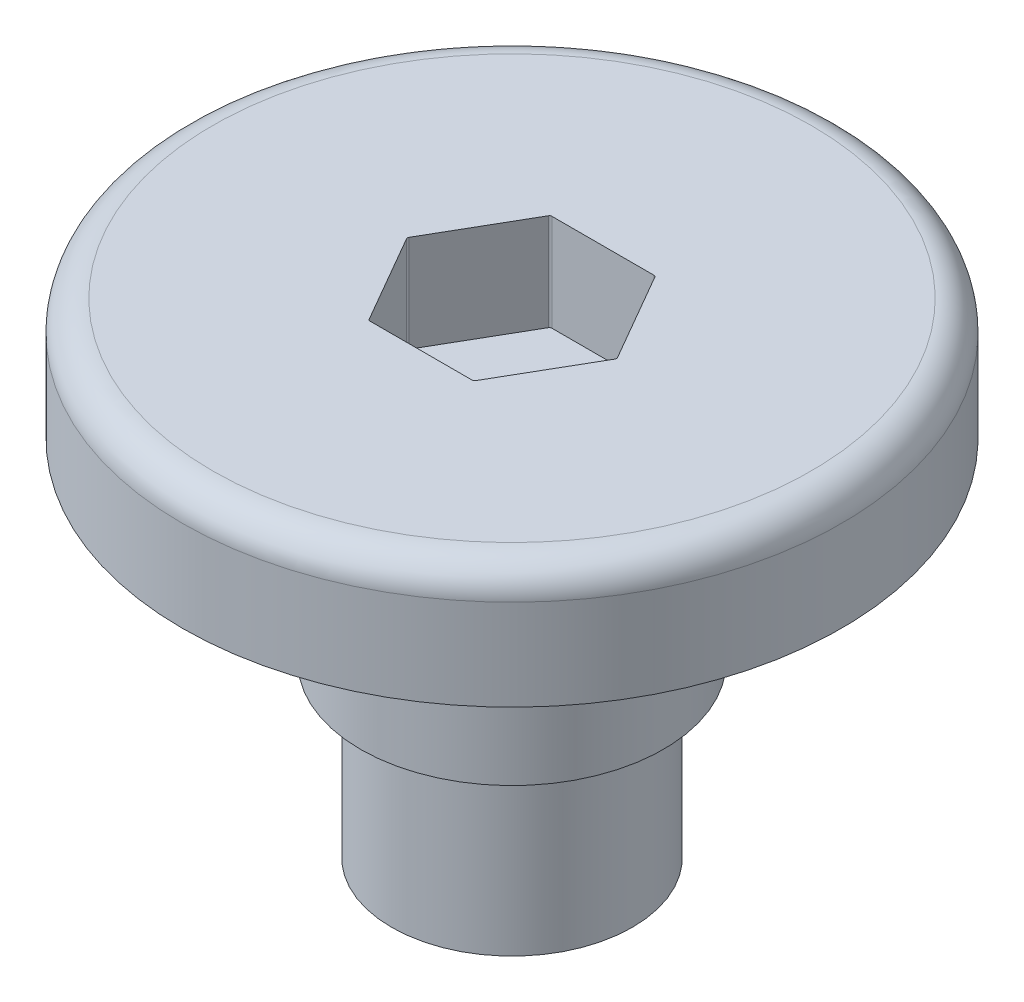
ISO-10303-21;
HEADER;
FILE_DESCRIPTION(('STEP AP214'),'2;1');
FILE_NAME('part.step','',(''),(''),'','','');
FILE_SCHEMA(('AUTOMOTIVE_DESIGN { 1 0 10303 214 1 1 1 1 }'));
ENDSEC;
DATA;
#1=APPLICATION_CONTEXT('core data for automotive mechanical design processes');
#2=APPLICATION_PROTOCOL_DEFINITION('international standard','automotive_design',2000,#1);
#3=PRODUCT_CONTEXT('',#1,'mechanical');
#4=PRODUCT('Part','Part','',(#3));
#5=PRODUCT_RELATED_PRODUCT_CATEGORY('part','',(#4));
#6=PRODUCT_DEFINITION_FORMATION('','',#4);
#7=PRODUCT_DEFINITION_CONTEXT('part definition',#1,'design');
#8=PRODUCT_DEFINITION('design','',#6,#7);
#9=PRODUCT_DEFINITION_SHAPE('','',#8);
#10=(LENGTH_UNIT() NAMED_UNIT(*) SI_UNIT(.MILLI.,.METRE.));
#11=(NAMED_UNIT(*) PLANE_ANGLE_UNIT() SI_UNIT($,.RADIAN.));
#12=(NAMED_UNIT(*) SI_UNIT($,.STERADIAN.) SOLID_ANGLE_UNIT());
#13=UNCERTAINTY_MEASURE_WITH_UNIT(LENGTH_MEASURE(1.E-05),#10,'distance_accuracy_value','');
#14=(GEOMETRIC_REPRESENTATION_CONTEXT(3) GLOBAL_UNCERTAINTY_ASSIGNED_CONTEXT((#13)) GLOBAL_UNIT_ASSIGNED_CONTEXT((#10,
#11,#12)) REPRESENTATION_CONTEXT('',''));
#15=CARTESIAN_POINT('',(0.,0.,0.));
#16=DIRECTION('',(0.,0.,1.));
#17=DIRECTION('',(1.,0.,0.));
#18=AXIS2_PLACEMENT_3D('',#15,#16,#17);
#19=CARTESIAN_POINT('',(-17.272,25.4,0.));
#20=DIRECTION('',(0.,-1.,0.));
#21=DIRECTION('',(0.,0.,-1.));
#22=AXIS2_PLACEMENT_3D('',#19,#20,#21);
#23=PLANE('',#22);
#24=CARTESIAN_POINT('',(0.,25.4,0.));
#25=DIRECTION('',(0.,-1.,0.));
#26=DIRECTION('',(0.,0.,-1.));
#27=AXIS2_PLACEMENT_3D('',#24,#25,#26);
#28=CIRCLE('',#27,15.6845);
#29=CARTESIAN_POINT('',(0.,25.4,-15.6845));
#30=VERTEX_POINT('',#29);
#31=EDGE_CURVE('E250',#30,#30,#28,.F.);
#32=ORIENTED_EDGE('',*,*,#31,.T.);
#33=EDGE_LOOP('',(#32));
#34=FACE_BOUND('',#33,.T.);
#35=DIRECTION('',(-1.,0.,0.));
#36=VECTOR('',#35,1.);
#37=CARTESIAN_POINT('',(2.74963065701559,25.4,-4.7625));
#38=LINE('',#37,#36);
#39=CARTESIAN_POINT('',(2.67630717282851,25.4,-4.7625));
#40=VERTEX_POINT('',#39);
#41=CARTESIAN_POINT('',(-2.67630717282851,25.4,-4.7625));
#42=VERTEX_POINT('',#41);
#43=EDGE_CURVE('E176',#40,#42,#38,.T.);
#44=ORIENTED_EDGE('',*,*,#43,.F.);
#45=CARTESIAN_POINT('',(2.67630717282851,25.4,-4.6355));
#46=DIRECTION('',(0.,-1.,0.));
#47=DIRECTION('',(0.,0.,-1.));
#48=AXIS2_PLACEMENT_3D('',#45,#46,#47);
#49=CIRCLE('',#48,0.127);
#50=CARTESIAN_POINT('',(2.78629239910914,25.4,-4.699));
#51=VERTEX_POINT('',#50);
#52=EDGE_CURVE('E67',#40,#51,#49,.T.);
#53=ORIENTED_EDGE('',*,*,#52,.T.);
#54=DIRECTION('',(-0.5,0.,-0.866025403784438));
#55=VECTOR('',#54,1.);
#56=CARTESIAN_POINT('',(5.49926131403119,25.4,0.));
#57=LINE('',#56,#55);
#58=CARTESIAN_POINT('',(5.46259957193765,25.4,-0.0635000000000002));
#59=VERTEX_POINT('',#58);
#60=EDGE_CURVE('E293',#59,#51,#57,.T.);
#61=ORIENTED_EDGE('',*,*,#60,.F.);
#62=CARTESIAN_POINT('',(5.35261434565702,25.4,0.));
#63=DIRECTION('',(0.,-1.,0.));
#64=DIRECTION('',(0.,0.,-1.));
#65=AXIS2_PLACEMENT_3D('',#62,#63,#64);
#66=CIRCLE('',#65,0.127);
#67=CARTESIAN_POINT('',(5.46259957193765,25.4,0.0634999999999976));
#68=VERTEX_POINT('',#67);
#69=EDGE_CURVE('E290',#59,#68,#66,.T.);
#70=ORIENTED_EDGE('',*,*,#69,.T.);
#71=DIRECTION('',(0.5,0.,-0.866025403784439));
#72=VECTOR('',#71,1.);
#73=CARTESIAN_POINT('',(2.74963065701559,25.4,4.7625));
#74=LINE('',#73,#72);
#75=CARTESIAN_POINT('',(2.78629239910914,25.4,4.699));
#76=VERTEX_POINT('',#75);
#77=EDGE_CURVE('E174',#76,#68,#74,.T.);
#78=ORIENTED_EDGE('',*,*,#77,.F.);
#79=CARTESIAN_POINT('',(2.67630717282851,25.4,4.6355));
#80=DIRECTION('',(0.,-1.,0.));
#81=DIRECTION('',(0.,0.,-1.));
#82=AXIS2_PLACEMENT_3D('',#79,#80,#81);
#83=CIRCLE('',#82,0.127);
#84=CARTESIAN_POINT('',(2.67630717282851,25.4,4.7625));
#85=VERTEX_POINT('',#84);
#86=EDGE_CURVE('E288',#76,#85,#83,.T.);
#87=ORIENTED_EDGE('',*,*,#86,.T.);
#88=DIRECTION('',(1.,0.,0.));
#89=VECTOR('',#88,1.);
#90=CARTESIAN_POINT('',(-2.74963065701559,25.4,4.7625));
#91=LINE('',#90,#89);
#92=CARTESIAN_POINT('',(-2.67630717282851,25.4,4.7625));
#93=VERTEX_POINT('',#92);
#94=EDGE_CURVE('E170',#93,#85,#91,.T.);
#95=ORIENTED_EDGE('',*,*,#94,.F.);
#96=CARTESIAN_POINT('',(-2.67630717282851,25.4,4.6355));
#97=DIRECTION('',(0.,-1.,0.));
#98=DIRECTION('',(0.,0.,-1.));
#99=AXIS2_PLACEMENT_3D('',#96,#97,#98);
#100=CIRCLE('',#99,0.127);
#101=CARTESIAN_POINT('',(-2.78629239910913,25.4,4.699));
#102=VERTEX_POINT('',#101);
#103=EDGE_CURVE('E155',#93,#102,#100,.T.);
#104=ORIENTED_EDGE('',*,*,#103,.T.);
#105=DIRECTION('',(0.5,0.,0.866025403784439));
#106=VECTOR('',#105,1.);
#107=CARTESIAN_POINT('',(-5.49926131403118,25.4,0.));
#108=LINE('',#107,#106);
#109=CARTESIAN_POINT('',(-5.46259957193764,25.4,0.0634999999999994));
#110=VERTEX_POINT('',#109);
#111=EDGE_CURVE('E162',#110,#102,#108,.T.);
#112=ORIENTED_EDGE('',*,*,#111,.F.);
#113=CARTESIAN_POINT('',(-5.35261434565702,25.4,0.));
#114=DIRECTION('',(0.,-1.,0.));
#115=DIRECTION('',(0.,0.,-1.));
#116=AXIS2_PLACEMENT_3D('',#113,#114,#115);
#117=CIRCLE('',#116,0.127);
#118=CARTESIAN_POINT('',(-5.46259957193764,25.4,-0.0635000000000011));
#119=VERTEX_POINT('',#118);
#120=EDGE_CURVE('E147',#110,#119,#117,.T.);
#121=ORIENTED_EDGE('',*,*,#120,.T.);
#122=DIRECTION('',(-0.5,0.,0.866025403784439));
#123=VECTOR('',#122,1.);
#124=CARTESIAN_POINT('',(-2.74963065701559,25.4,-4.7625));
#125=LINE('',#124,#123);
#126=CARTESIAN_POINT('',(-2.78629239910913,25.4,-4.699));
#127=VERTEX_POINT('',#126);
#128=EDGE_CURVE('E171',#127,#119,#125,.T.);
#129=ORIENTED_EDGE('',*,*,#128,.F.);
#130=CARTESIAN_POINT('',(-2.67630717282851,25.4,-4.6355));
#131=DIRECTION('',(0.,-1.,0.));
#132=DIRECTION('',(0.,0.,-1.));
#133=AXIS2_PLACEMENT_3D('',#130,#131,#132);
#134=CIRCLE('',#133,0.127);
#135=EDGE_CURVE('E14',#127,#42,#134,.T.);
#136=ORIENTED_EDGE('',*,*,#135,.T.);
#137=EDGE_LOOP('',(#44,#53,#61,#70,#78,#87,#95,#104,#112,#121,#129,#136));
#138=FACE_BOUND('',#137,.T.);
#139=ADVANCED_FACE('F59',(#34,#138),#23,.F.);
#140=CARTESIAN_POINT('',(0.,0.,0.));
#141=DIRECTION('',(0.,-1.,0.));
#142=DIRECTION('',(0.,0.,-1.));
#143=AXIS2_PLACEMENT_3D('',#140,#141,#142);
#144=CYLINDRICAL_SURFACE('',#143,17.272);
#145=CARTESIAN_POINT('',(0.,23.8125,0.));
#146=DIRECTION('',(0.,-1.,0.));
#147=DIRECTION('',(0.,0.,-1.));
#148=AXIS2_PLACEMENT_3D('',#145,#146,#147);
#149=CIRCLE('',#148,17.272);
#150=CARTESIAN_POINT('',(0.,23.8125,-17.272));
#151=VERTEX_POINT('',#150);
#152=EDGE_CURVE('E247',#151,#151,#149,.T.);
#153=ORIENTED_EDGE('',*,*,#152,.T.);
#154=EDGE_LOOP('',(#153));
#155=FACE_BOUND('',#154,.T.);
#156=CARTESIAN_POINT('',(0.,19.05,0.));
#157=DIRECTION('',(0.,-1.,0.));
#158=DIRECTION('',(0.,0.,-1.));
#159=AXIS2_PLACEMENT_3D('',#156,#157,#158);
#160=CIRCLE('',#159,17.272);
#161=CARTESIAN_POINT('',(0.,19.05,-17.272));
#162=VERTEX_POINT('',#161);
#163=EDGE_CURVE('E244',#162,#162,#160,.T.);
#164=ORIENTED_EDGE('',*,*,#163,.F.);
#165=EDGE_LOOP('',(#164));
#166=FACE_BOUND('',#165,.T.);
#167=ADVANCED_FACE('F337',(#155,#166),#144,.T.);
#168=CARTESIAN_POINT('',(-14.859,19.05,0.));
#169=DIRECTION('',(0.,1.,0.));
#170=DIRECTION('',(0.,0.,1.));
#171=AXIS2_PLACEMENT_3D('',#168,#169,#170);
#172=PLANE('',#171);
#173=CARTESIAN_POINT('',(0.,19.05,0.));
#174=DIRECTION('',(0.,-1.,0.));
#175=DIRECTION('',(0.,0.,-1.));
#176=AXIS2_PLACEMENT_3D('',#173,#174,#175);
#177=CIRCLE('',#176,14.859);
#178=CARTESIAN_POINT('',(0.,19.05,-14.859));
#179=VERTEX_POINT('',#178);
#180=EDGE_CURVE('E241',#179,#179,#177,.T.);
#181=ORIENTED_EDGE('',*,*,#180,.F.);
#182=EDGE_LOOP('',(#181));
#183=FACE_BOUND('',#182,.T.);
#184=ORIENTED_EDGE('',*,*,#163,.T.);
#185=EDGE_LOOP('',(#184));
#186=FACE_BOUND('',#185,.T.);
#187=ADVANCED_FACE('F343',(#183,#186),#172,.F.);
#188=CARTESIAN_POINT('',(0.,19.177,0.));
#189=DIRECTION('',(0.,-1.,0.));
#190=DIRECTION('',(0.,0.,-1.));
#191=AXIS2_PLACEMENT_3D('',#188,#189,#190);
#192=TOROIDAL_SURFACE('',#191,14.859,0.127);
#193=CARTESIAN_POINT('',(0.,19.177,0.));
#194=DIRECTION('',(0.,-1.,0.));
#195=DIRECTION('',(0.,0.,-1.));
#196=AXIS2_PLACEMENT_3D('',#193,#194,#195);
#197=CIRCLE('',#196,14.732);
#198=CARTESIAN_POINT('',(0.,19.177,-14.732));
#199=VERTEX_POINT('',#198);
#200=EDGE_CURVE('E238',#199,#199,#197,.T.);
#201=ORIENTED_EDGE('',*,*,#200,.F.);
#202=EDGE_LOOP('',(#201));
#203=FACE_BOUND('',#202,.T.);
#204=ORIENTED_EDGE('',*,*,#180,.T.);
#205=EDGE_LOOP('',(#204));
#206=FACE_BOUND('',#205,.T.);
#207=ADVANCED_FACE('F660',(#203,#206),#192,.T.);
#208=CARTESIAN_POINT('',(0.,0.,0.));
#209=DIRECTION('',(0.,-1.,0.));
#210=DIRECTION('',(0.,0.,-1.));
#211=AXIS2_PLACEMENT_3D('',#208,#209,#210);
#212=CYLINDRICAL_SURFACE('',#211,14.732);
#213=CARTESIAN_POINT('',(0.,21.2471,0.));
#214=DIRECTION('',(0.,-1.,0.));
#215=DIRECTION('',(0.,0.,-1.));
#216=AXIS2_PLACEMENT_3D('',#213,#214,#215);
#217=CIRCLE('',#216,14.732);
#218=CARTESIAN_POINT('',(0.,21.2471,-14.732));
#219=VERTEX_POINT('',#218);
#220=EDGE_CURVE('E235',#219,#219,#217,.T.);
#221=ORIENTED_EDGE('',*,*,#220,.F.);
#222=EDGE_LOOP('',(#221));
#223=FACE_BOUND('',#222,.T.);
#224=ORIENTED_EDGE('',*,*,#200,.T.);
#225=EDGE_LOOP('',(#224));
#226=FACE_BOUND('',#225,.T.);
#227=ADVANCED_FACE('F650',(#223,#226),#212,.F.);
#228=CARTESIAN_POINT('',(0.,21.2471,0.));
#229=DIRECTION('',(0.,-1.,0.));
#230=DIRECTION('',(0.,0.,-1.));
#231=AXIS2_PLACEMENT_3D('',#228,#229,#230);
#232=TOROIDAL_SURFACE('',#231,14.2875,0.444500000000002);
#233=CARTESIAN_POINT('',(0.,21.6916,0.));
#234=DIRECTION('',(0.,-1.,0.));
#235=DIRECTION('',(0.,0.,-1.));
#236=AXIS2_PLACEMENT_3D('',#233,#234,#235);
#237=CIRCLE('',#236,14.2875);
#238=CARTESIAN_POINT('',(0.,21.6916,-14.2875));
#239=VERTEX_POINT('',#238);
#240=EDGE_CURVE('E232',#239,#239,#237,.T.);
#241=ORIENTED_EDGE('',*,*,#240,.F.);
#242=EDGE_LOOP('',(#241));
#243=FACE_BOUND('',#242,.T.);
#244=ORIENTED_EDGE('',*,*,#220,.T.);
#245=EDGE_LOOP('',(#244));
#246=FACE_BOUND('',#245,.T.);
#247=ADVANCED_FACE('F640',(#243,#246),#232,.F.);
#248=CARTESIAN_POINT('',(-10.5537,21.6916,0.));
#249=DIRECTION('',(0.,1.,0.));
#250=DIRECTION('',(0.,0.,1.));
#251=AXIS2_PLACEMENT_3D('',#248,#249,#250);
#252=PLANE('',#251);
#253=CARTESIAN_POINT('',(0.,21.6916,0.));
#254=DIRECTION('',(0.,-1.,0.));
#255=DIRECTION('',(0.,0.,-1.));
#256=AXIS2_PLACEMENT_3D('',#253,#254,#255);
#257=CIRCLE('',#256,10.5537);
#258=CARTESIAN_POINT('',(0.,21.6916,-10.5537));
#259=VERTEX_POINT('',#258);
#260=EDGE_CURVE('E229',#259,#259,#257,.T.);
#261=ORIENTED_EDGE('',*,*,#260,.F.);
#262=EDGE_LOOP('',(#261));
#263=FACE_BOUND('',#262,.T.);
#264=ORIENTED_EDGE('',*,*,#240,.T.);
#265=EDGE_LOOP('',(#264));
#266=FACE_BOUND('',#265,.T.);
#267=ADVANCED_FACE('F630',(#263,#266),#252,.F.);
#268=CARTESIAN_POINT('',(0.,21.2471,0.));
#269=DIRECTION('',(0.,-1.,0.));
#270=DIRECTION('',(0.,0.,-1.));
#271=AXIS2_PLACEMENT_3D('',#268,#269,#270);
#272=TOROIDAL_SURFACE('',#271,10.5537,0.444500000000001);
#273=CARTESIAN_POINT('',(0.,21.2471,0.));
#274=DIRECTION('',(0.,-1.,0.));
#275=DIRECTION('',(0.,0.,-1.));
#276=AXIS2_PLACEMENT_3D('',#273,#274,#275);
#277=CIRCLE('',#276,10.1092);
#278=CARTESIAN_POINT('',(0.,21.2471,-10.1092));
#279=VERTEX_POINT('',#278);
#280=EDGE_CURVE('E226',#279,#279,#277,.T.);
#281=ORIENTED_EDGE('',*,*,#280,.F.);
#282=EDGE_LOOP('',(#281));
#283=FACE_BOUND('',#282,.T.);
#284=ORIENTED_EDGE('',*,*,#260,.T.);
#285=EDGE_LOOP('',(#284));
#286=FACE_BOUND('',#285,.T.);
#287=ADVANCED_FACE('F620',(#283,#286),#272,.F.);
#288=CARTESIAN_POINT('',(0.,0.,0.));
#289=DIRECTION('',(0.,-1.,0.));
#290=DIRECTION('',(0.,0.,-1.));
#291=AXIS2_PLACEMENT_3D('',#288,#289,#290);
#292=CYLINDRICAL_SURFACE('',#291,10.1092);
#293=CARTESIAN_POINT('',(0.,19.177,0.));
#294=DIRECTION('',(0.,-1.,0.));
#295=DIRECTION('',(0.,0.,-1.));
#296=AXIS2_PLACEMENT_3D('',#293,#294,#295);
#297=CIRCLE('',#296,10.1092);
#298=CARTESIAN_POINT('',(0.,19.177,-10.1092));
#299=VERTEX_POINT('',#298);
#300=EDGE_CURVE('E223',#299,#299,#297,.T.);
#301=ORIENTED_EDGE('',*,*,#300,.F.);
#302=EDGE_LOOP('',(#301));
#303=FACE_BOUND('',#302,.T.);
#304=ORIENTED_EDGE('',*,*,#280,.T.);
#305=EDGE_LOOP('',(#304));
#306=FACE_BOUND('',#305,.T.);
#307=ADVANCED_FACE('F610',(#303,#306),#292,.T.);
#308=CARTESIAN_POINT('',(0.,19.177,0.));
#309=DIRECTION('',(0.,-1.,0.));
#310=DIRECTION('',(0.,0.,-1.));
#311=AXIS2_PLACEMENT_3D('',#308,#309,#310);
#312=TOROIDAL_SURFACE('',#311,9.9822,0.127000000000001);
#313=CARTESIAN_POINT('',(0.,19.05,0.));
#314=DIRECTION('',(0.,-1.,0.));
#315=DIRECTION('',(0.,0.,-1.));
#316=AXIS2_PLACEMENT_3D('',#313,#314,#315);
#317=CIRCLE('',#316,9.9822);
#318=CARTESIAN_POINT('',(0.,19.05,-9.9822));
#319=VERTEX_POINT('',#318);
#320=EDGE_CURVE('E220',#319,#319,#317,.T.);
#321=ORIENTED_EDGE('',*,*,#320,.F.);
#322=EDGE_LOOP('',(#321));
#323=FACE_BOUND('',#322,.T.);
#324=ORIENTED_EDGE('',*,*,#300,.T.);
#325=EDGE_LOOP('',(#324));
#326=FACE_BOUND('',#325,.T.);
#327=ADVANCED_FACE('F600',(#323,#326),#312,.T.);
#328=CARTESIAN_POINT('',(-7.9375,19.05,0.));
#329=DIRECTION('',(0.,1.,0.));
#330=DIRECTION('',(0.,0.,1.));
#331=AXIS2_PLACEMENT_3D('',#328,#329,#330);
#332=PLANE('',#331);
#333=CARTESIAN_POINT('',(0.,19.05,0.));
#334=DIRECTION('',(0.,-1.,0.));
#335=DIRECTION('',(0.,0.,-1.));
#336=AXIS2_PLACEMENT_3D('',#333,#334,#335);
#337=CIRCLE('',#336,7.9375);
#338=CARTESIAN_POINT('',(0.,19.05,-7.9375));
#339=VERTEX_POINT('',#338);
#340=EDGE_CURVE('E217',#339,#339,#337,.T.);
#341=ORIENTED_EDGE('',*,*,#340,.F.);
#342=EDGE_LOOP('',(#341));
#343=FACE_BOUND('',#342,.T.);
#344=ORIENTED_EDGE('',*,*,#320,.T.);
#345=EDGE_LOOP('',(#344));
#346=FACE_BOUND('',#345,.T.);
#347=ADVANCED_FACE('F590',(#343,#346),#332,.F.);
#348=CARTESIAN_POINT('',(0.,0.,0.));
#349=DIRECTION('',(0.,-1.,0.));
#350=DIRECTION('',(0.,0.,-1.));
#351=AXIS2_PLACEMENT_3D('',#348,#349,#350);
#352=CYLINDRICAL_SURFACE('',#351,7.9375);
#353=CARTESIAN_POINT('',(0.,17.145,0.));
#354=DIRECTION('',(0.,-1.,0.));
#355=DIRECTION('',(0.,0.,-1.));
#356=AXIS2_PLACEMENT_3D('',#353,#354,#355);
#357=CIRCLE('',#356,7.9375);
#358=CARTESIAN_POINT('',(0.,17.145,-7.9375));
#359=VERTEX_POINT('',#358);
#360=EDGE_CURVE('E214',#359,#359,#357,.T.);
#361=ORIENTED_EDGE('',*,*,#360,.F.);
#362=EDGE_LOOP('',(#361));
#363=FACE_BOUND('',#362,.T.);
#364=ORIENTED_EDGE('',*,*,#340,.T.);
#365=EDGE_LOOP('',(#364));
#366=FACE_BOUND('',#365,.T.);
#367=ADVANCED_FACE('F580',(#363,#366),#352,.T.);
#368=CARTESIAN_POINT('',(0.,17.145,0.));
#369=DIRECTION('',(0.,-1.,0.));
#370=DIRECTION('',(0.,0.,-1.));
#371=AXIS2_PLACEMENT_3D('',#368,#369,#370);
#372=TOROIDAL_SURFACE('',#371,7.8105,0.126999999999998);
#373=CARTESIAN_POINT('',(0.,17.018,0.));
#374=DIRECTION('',(0.,-1.,0.));
#375=DIRECTION('',(0.,0.,-1.));
#376=AXIS2_PLACEMENT_3D('',#373,#374,#375);
#377=CIRCLE('',#376,7.8105);
#378=CARTESIAN_POINT('',(0.,17.018,-7.8105));
#379=VERTEX_POINT('',#378);
#380=EDGE_CURVE('E211',#379,#379,#377,.T.);
#381=ORIENTED_EDGE('',*,*,#380,.F.);
#382=EDGE_LOOP('',(#381));
#383=FACE_BOUND('',#382,.T.);
#384=ORIENTED_EDGE('',*,*,#360,.T.);
#385=EDGE_LOOP('',(#384));
#386=FACE_BOUND('',#385,.T.);
#387=ADVANCED_FACE('F570',(#383,#386),#372,.T.);
#388=CARTESIAN_POINT('',(-7.8105,17.018,0.));
#389=DIRECTION('',(0.,1.,0.));
#390=DIRECTION('',(0.,0.,1.));
#391=AXIS2_PLACEMENT_3D('',#388,#389,#390);
#392=PLANE('',#391);
#393=CARTESIAN_POINT('',(0.,17.018,0.));
#394=DIRECTION('',(0.,-1.,0.));
#395=DIRECTION('',(0.,0.,-1.));
#396=AXIS2_PLACEMENT_3D('',#393,#394,#395);
#397=CIRCLE('',#396,6.1341);
#398=CARTESIAN_POINT('',(0.,17.018,-6.1341));
#399=VERTEX_POINT('',#398);
#400=EDGE_CURVE('E208',#399,#399,#397,.T.);
#401=ORIENTED_EDGE('',*,*,#400,.F.);
#402=EDGE_LOOP('',(#401));
#403=FACE_BOUND('',#402,.T.);
#404=ORIENTED_EDGE('',*,*,#380,.T.);
#405=EDGE_LOOP('',(#404));
#406=FACE_BOUND('',#405,.T.);
#407=ADVANCED_FACE('F560',(#403,#406),#392,.F.);
#408=CARTESIAN_POINT('',(0.,16.764,0.));
#409=DIRECTION('',(0.,-1.,0.));
#410=DIRECTION('',(0.,0.,-1.));
#411=AXIS2_PLACEMENT_3D('',#408,#409,#410);
#412=TOROIDAL_SURFACE('',#411,6.1341,0.254000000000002);
#413=CARTESIAN_POINT('',(0.,16.764,0.));
#414=DIRECTION('',(0.,-1.,0.));
#415=DIRECTION('',(0.,0.,-1.));
#416=AXIS2_PLACEMENT_3D('',#413,#414,#415);
#417=CIRCLE('',#416,5.8801);
#418=CARTESIAN_POINT('',(0.,16.764,-5.8801));
#419=VERTEX_POINT('',#418);
#420=EDGE_CURVE('E205',#419,#419,#417,.T.);
#421=ORIENTED_EDGE('',*,*,#420,.F.);
#422=EDGE_LOOP('',(#421));
#423=FACE_BOUND('',#422,.T.);
#424=ORIENTED_EDGE('',*,*,#400,.T.);
#425=EDGE_LOOP('',(#424));
#426=FACE_BOUND('',#425,.T.);
#427=ADVANCED_FACE('F550',(#423,#426),#412,.F.);
#428=CARTESIAN_POINT('',(0.,0.,0.));
#429=DIRECTION('',(0.,-1.,0.));
#430=DIRECTION('',(0.,0.,-1.));
#431=AXIS2_PLACEMENT_3D('',#428,#429,#430);
#432=CYLINDRICAL_SURFACE('',#431,5.8801);
#433=CARTESIAN_POINT('',(0.,13.6525,0.));
#434=DIRECTION('',(0.,-1.,0.));
#435=DIRECTION('',(0.,0.,-1.));
#436=AXIS2_PLACEMENT_3D('',#433,#434,#435);
#437=CIRCLE('',#436,5.8801);
#438=CARTESIAN_POINT('',(0.,13.6525,-5.8801));
#439=VERTEX_POINT('',#438);
#440=EDGE_CURVE('E202',#439,#439,#437,.T.);
#441=ORIENTED_EDGE('',*,*,#440,.F.);
#442=EDGE_LOOP('',(#441));
#443=FACE_BOUND('',#442,.T.);
#444=ORIENTED_EDGE('',*,*,#420,.T.);
#445=EDGE_LOOP('',(#444));
#446=FACE_BOUND('',#445,.T.);
#447=ADVANCED_FACE('F540',(#443,#446),#432,.T.);
#448=CARTESIAN_POINT('',(0.,13.6525,0.));
#449=DIRECTION('',(0.,-1.,0.));
#450=DIRECTION('',(0.,0.,-1.));
#451=AXIS2_PLACEMENT_3D('',#448,#449,#450);
#452=TOROIDAL_SURFACE('',#451,6.1341,0.254);
#453=CARTESIAN_POINT('',(0.,13.3985,0.));
#454=DIRECTION('',(0.,-1.,0.));
#455=DIRECTION('',(0.,0.,-1.));
#456=AXIS2_PLACEMENT_3D('',#453,#454,#455);
#457=CIRCLE('',#456,6.1341);
#458=CARTESIAN_POINT('',(0.,13.3985,-6.1341));
#459=VERTEX_POINT('',#458);
#460=EDGE_CURVE('E199',#459,#459,#457,.T.);
#461=ORIENTED_EDGE('',*,*,#460,.F.);
#462=EDGE_LOOP('',(#461));
#463=FACE_BOUND('',#462,.T.);
#464=ORIENTED_EDGE('',*,*,#440,.T.);
#465=EDGE_LOOP('',(#464));
#466=FACE_BOUND('',#465,.T.);
#467=ADVANCED_FACE('F530',(#463,#466),#452,.F.);
#468=CARTESIAN_POINT('',(-6.1341,13.3985,0.));
#469=DIRECTION('',(0.,-1.,0.));
#470=DIRECTION('',(0.,0.,-1.));
#471=AXIS2_PLACEMENT_3D('',#468,#469,#470);
#472=PLANE('',#471);
#473=CARTESIAN_POINT('',(0.,13.3985,0.));
#474=DIRECTION('',(0.,-1.,0.));
#475=DIRECTION('',(0.,0.,-1.));
#476=AXIS2_PLACEMENT_3D('',#473,#474,#475);
#477=CIRCLE('',#476,7.8105);
#478=CARTESIAN_POINT('',(0.,13.3985,-7.8105));
#479=VERTEX_POINT('',#478);
#480=EDGE_CURVE('E196',#479,#479,#477,.T.);
#481=ORIENTED_EDGE('',*,*,#480,.F.);
#482=EDGE_LOOP('',(#481));
#483=FACE_BOUND('',#482,.T.);
#484=ORIENTED_EDGE('',*,*,#460,.T.);
#485=EDGE_LOOP('',(#484));
#486=FACE_BOUND('',#485,.T.);
#487=ADVANCED_FACE('F520',(#483,#486),#472,.F.);
#488=CARTESIAN_POINT('',(0.,13.2715,0.));
#489=DIRECTION('',(0.,-1.,0.));
#490=DIRECTION('',(0.,0.,-1.));
#491=AXIS2_PLACEMENT_3D('',#488,#489,#490);
#492=TOROIDAL_SURFACE('',#491,7.8105,0.127);
#493=CARTESIAN_POINT('',(0.,13.2715,0.));
#494=DIRECTION('',(0.,-1.,0.));
#495=DIRECTION('',(0.,0.,-1.));
#496=AXIS2_PLACEMENT_3D('',#493,#494,#495);
#497=CIRCLE('',#496,7.9375);
#498=CARTESIAN_POINT('',(0.,13.2715,-7.9375));
#499=VERTEX_POINT('',#498);
#500=EDGE_CURVE('E193',#499,#499,#497,.T.);
#501=ORIENTED_EDGE('',*,*,#500,.F.);
#502=EDGE_LOOP('',(#501));
#503=FACE_BOUND('',#502,.T.);
#504=ORIENTED_EDGE('',*,*,#480,.T.);
#505=EDGE_LOOP('',(#504));
#506=FACE_BOUND('',#505,.T.);
#507=ADVANCED_FACE('F509',(#503,#506),#492,.T.);
#508=CARTESIAN_POINT('',(0.,0.,0.));
#509=DIRECTION('',(0.,-1.,0.));
#510=DIRECTION('',(0.,0.,-1.));
#511=AXIS2_PLACEMENT_3D('',#508,#509,#510);
#512=CYLINDRICAL_SURFACE('',#511,7.9375);
#513=CARTESIAN_POINT('',(0.,8.89,0.));
#514=DIRECTION('',(0.,-1.,0.));
#515=DIRECTION('',(0.,0.,-1.));
#516=AXIS2_PLACEMENT_3D('',#513,#514,#515);
#517=CIRCLE('',#516,7.9375);
#518=CARTESIAN_POINT('',(0.,8.89,-7.9375));
#519=VERTEX_POINT('',#518);
#520=EDGE_CURVE('E190',#519,#519,#517,.T.);
#521=ORIENTED_EDGE('',*,*,#520,.F.);
#522=EDGE_LOOP('',(#521));
#523=FACE_BOUND('',#522,.T.);
#524=ORIENTED_EDGE('',*,*,#500,.T.);
#525=EDGE_LOOP('',(#524));
#526=FACE_BOUND('',#525,.T.);
#527=ADVANCED_FACE('F498',(#523,#526),#512,.T.);
#528=CARTESIAN_POINT('',(-7.9375,8.89,0.));
#529=DIRECTION('',(0.,1.,0.));
#530=DIRECTION('',(0.,0.,1.));
#531=AXIS2_PLACEMENT_3D('',#528,#529,#530);
#532=PLANE('',#531);
#533=CARTESIAN_POINT('',(0.,8.89,0.));
#534=DIRECTION('',(0.,-1.,0.));
#535=DIRECTION('',(0.,0.,-1.));
#536=AXIS2_PLACEMENT_3D('',#533,#534,#535);
#537=CIRCLE('',#536,6.3119);
#538=CARTESIAN_POINT('',(0.,8.89,-6.3119));
#539=VERTEX_POINT('',#538);
#540=EDGE_CURVE('E186',#539,#539,#537,.T.);
#541=ORIENTED_EDGE('',*,*,#540,.F.);
#542=EDGE_LOOP('',(#541));
#543=FACE_BOUND('',#542,.T.);
#544=ORIENTED_EDGE('',*,*,#520,.T.);
#545=EDGE_LOOP('',(#544));
#546=FACE_BOUND('',#545,.T.);
#547=ADVANCED_FACE('F488',(#543,#546),#532,.F.);
#548=CARTESIAN_POINT('',(0.,0.,0.));
#549=DIRECTION('',(0.,-1.,0.));
#550=DIRECTION('',(0.,0.,-1.));
#551=AXIS2_PLACEMENT_3D('',#548,#549,#550);
#552=CYLINDRICAL_SURFACE('',#551,6.3119);
#553=CARTESIAN_POINT('',(0.,0.,0.));
#554=DIRECTION('',(0.,-1.,0.));
#555=DIRECTION('',(0.,0.,-1.));
#556=AXIS2_PLACEMENT_3D('',#553,#554,#555);
#557=CIRCLE('',#556,6.3119);
#558=CARTESIAN_POINT('',(0.,0.,-6.3119));
#559=VERTEX_POINT('',#558);
#560=EDGE_CURVE('E183',#559,#559,#557,.T.);
#561=ORIENTED_EDGE('',*,*,#560,.F.);
#562=EDGE_LOOP('',(#561));
#563=FACE_BOUND('',#562,.T.);
#564=ORIENTED_EDGE('',*,*,#540,.T.);
#565=EDGE_LOOP('',(#564));
#566=FACE_BOUND('',#565,.T.);
#567=ADVANCED_FACE('F478',(#563,#566),#552,.T.);
#568=CARTESIAN_POINT('',(0.,0.,0.));
#569=DIRECTION('',(0.,1.,0.));
#570=DIRECTION('',(0.,0.,1.));
#571=AXIS2_PLACEMENT_3D('',#568,#569,#570);
#572=PLANE('',#571);
#573=ORIENTED_EDGE('',*,*,#560,.T.);
#574=EDGE_LOOP('',(#573));
#575=FACE_BOUND('',#574,.T.);
#576=ADVANCED_FACE('F451',(#575),#572,.F.);
#577=CARTESIAN_POINT('',(5.49926131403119,20.32,0.));
#578=DIRECTION('',(0.866025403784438,0.,-0.5));
#579=DIRECTION('',(-0.5,0.,-0.866025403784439));
#580=AXIS2_PLACEMENT_3D('',#577,#578,#579);
#581=PLANE('',#580);
#582=DIRECTION('',(-0.5,0.,-0.866025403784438));
#583=VECTOR('',#582,1.);
#584=CARTESIAN_POINT('',(5.49926131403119,20.32,0.));
#585=LINE('',#584,#583);
#586=CARTESIAN_POINT('',(5.46259957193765,20.32,-0.0635000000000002));
#587=VERTEX_POINT('',#586);
#588=CARTESIAN_POINT('',(2.78629239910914,20.32,-4.699));
#589=VERTEX_POINT('',#588);
#590=EDGE_CURVE('E182',#587,#589,#585,.T.);
#591=ORIENTED_EDGE('',*,*,#590,.F.);
#592=DIRECTION('',(0.,1.,0.));
#593=VECTOR('',#592,1.);
#594=CARTESIAN_POINT('',(5.46259957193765,25.4,-0.0635000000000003));
#595=LINE('',#594,#593);
#596=EDGE_CURVE('E281',#587,#59,#595,.T.);
#597=ORIENTED_EDGE('',*,*,#596,.T.);
#598=ORIENTED_EDGE('',*,*,#60,.T.);
#599=DIRECTION('',(0.,1.,0.));
#600=VECTOR('',#599,1.);
#601=CARTESIAN_POINT('',(2.78629239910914,20.32,-4.699));
#602=LINE('',#601,#600);
#603=EDGE_CURVE('E279',#51,#589,#602,.F.);
#604=ORIENTED_EDGE('',*,*,#603,.T.);
#605=EDGE_LOOP('',(#591,#597,#598,#604));
#606=FACE_BOUND('',#605,.T.);
#607=ADVANCED_FACE('F296',(#606),#581,.F.);
#608=CARTESIAN_POINT('',(2.74963065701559,20.32,4.7625));
#609=DIRECTION('',(0.866025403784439,0.,0.5));
#610=DIRECTION('',(0.5,0.,-0.866025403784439));
#611=AXIS2_PLACEMENT_3D('',#608,#609,#610);
#612=PLANE('',#611);
#613=DIRECTION('',(0.5,0.,-0.866025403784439));
#614=VECTOR('',#613,1.);
#615=CARTESIAN_POINT('',(2.74963065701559,20.32,4.7625));
#616=LINE('',#615,#614);
#617=CARTESIAN_POINT('',(2.78629239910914,20.32,4.699));
#618=VERTEX_POINT('',#617);
#619=CARTESIAN_POINT('',(5.46259957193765,20.32,0.0634999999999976));
#620=VERTEX_POINT('',#619);
#621=EDGE_CURVE('E187',#618,#620,#616,.T.);
#622=ORIENTED_EDGE('',*,*,#621,.F.);
#623=DIRECTION('',(0.,1.,0.));
#624=VECTOR('',#623,1.);
#625=CARTESIAN_POINT('',(2.78629239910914,25.4,4.699));
#626=LINE('',#625,#624);
#627=EDGE_CURVE('E276',#618,#76,#626,.T.);
#628=ORIENTED_EDGE('',*,*,#627,.T.);
#629=ORIENTED_EDGE('',*,*,#77,.T.);
#630=DIRECTION('',(0.,1.,0.));
#631=VECTOR('',#630,1.);
#632=CARTESIAN_POINT('',(5.46259957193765,20.32,0.063499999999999));
#633=LINE('',#632,#631);
#634=EDGE_CURVE('E274',#68,#620,#633,.F.);
#635=ORIENTED_EDGE('',*,*,#634,.T.);
#636=EDGE_LOOP('',(#622,#628,#629,#635));
#637=FACE_BOUND('',#636,.T.);
#638=ADVANCED_FACE('F433',(#637),#612,.F.);
#639=CARTESIAN_POINT('',(-2.74963065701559,20.32,4.7625));
#640=DIRECTION('',(0.,0.,1.));
#641=DIRECTION('',(1.,0.,0.));
#642=AXIS2_PLACEMENT_3D('',#639,#640,#641);
#643=PLANE('',#642);
#644=DIRECTION('',(1.,0.,0.));
#645=VECTOR('',#644,1.);
#646=CARTESIAN_POINT('',(-2.74963065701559,20.32,4.7625));
#647=LINE('',#646,#645);
#648=CARTESIAN_POINT('',(-2.67630717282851,20.32,4.7625));
#649=VERTEX_POINT('',#648);
#650=CARTESIAN_POINT('',(2.67630717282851,20.32,4.7625));
#651=VERTEX_POINT('',#650);
#652=EDGE_CURVE('E318',#649,#651,#647,.T.);
#653=ORIENTED_EDGE('',*,*,#652,.F.);
#654=DIRECTION('',(0.,1.,0.));
#655=VECTOR('',#654,1.);
#656=CARTESIAN_POINT('',(-2.67630717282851,25.4,4.7625));
#657=LINE('',#656,#655);
#658=EDGE_CURVE('E271',#649,#93,#657,.T.);
#659=ORIENTED_EDGE('',*,*,#658,.T.);
#660=ORIENTED_EDGE('',*,*,#94,.T.);
#661=DIRECTION('',(0.,1.,0.));
#662=VECTOR('',#661,1.);
#663=CARTESIAN_POINT('',(2.67630717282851,20.32,4.7625));
#664=LINE('',#663,#662);
#665=EDGE_CURVE('E269',#85,#651,#664,.F.);
#666=ORIENTED_EDGE('',*,*,#665,.T.);
#667=EDGE_LOOP('',(#653,#659,#660,#666));
#668=FACE_BOUND('',#667,.T.);
#669=ADVANCED_FACE('F334',(#668),#643,.F.);
#670=CARTESIAN_POINT('',(-5.49926131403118,20.32,0.));
#671=DIRECTION('',(-0.866025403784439,0.,0.5));
#672=DIRECTION('',(0.5,0.,0.866025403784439));
#673=AXIS2_PLACEMENT_3D('',#670,#671,#672);
#674=PLANE('',#673);
#675=DIRECTION('',(0.5,0.,0.866025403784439));
#676=VECTOR('',#675,1.);
#677=CARTESIAN_POINT('',(-5.49926131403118,20.32,0.));
#678=LINE('',#677,#676);
#679=CARTESIAN_POINT('',(-5.46259957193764,20.32,0.0634999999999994));
#680=VERTEX_POINT('',#679);
#681=CARTESIAN_POINT('',(-2.78629239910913,20.32,4.699));
#682=VERTEX_POINT('',#681);
#683=EDGE_CURVE('E165',#680,#682,#678,.T.);
#684=ORIENTED_EDGE('',*,*,#683,.F.);
#685=DIRECTION('',(0.,1.,0.));
#686=VECTOR('',#685,1.);
#687=CARTESIAN_POINT('',(-5.46259957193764,25.4,0.0634999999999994));
#688=LINE('',#687,#686);
#689=EDGE_CURVE('E151',#680,#110,#688,.T.);
#690=ORIENTED_EDGE('',*,*,#689,.T.);
#691=ORIENTED_EDGE('',*,*,#111,.T.);
#692=DIRECTION('',(0.,1.,0.));
#693=VECTOR('',#692,1.);
#694=CARTESIAN_POINT('',(-2.78629239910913,20.32,4.699));
#695=LINE('',#694,#693);
#696=EDGE_CURVE('E167',#102,#682,#695,.F.);
#697=ORIENTED_EDGE('',*,*,#696,.T.);
#698=EDGE_LOOP('',(#684,#690,#691,#697));
#699=FACE_BOUND('',#698,.T.);
#700=ADVANCED_FACE('F161',(#699),#674,.F.);
#701=CARTESIAN_POINT('',(-2.74963065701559,20.32,-4.7625));
#702=DIRECTION('',(-0.866025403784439,0.,-0.5));
#703=DIRECTION('',(-0.5,0.,0.866025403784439));
#704=AXIS2_PLACEMENT_3D('',#701,#702,#703);
#705=PLANE('',#704);
#706=ORIENTED_EDGE('',*,*,#128,.T.);
#707=DIRECTION('',(0.,1.,0.));
#708=VECTOR('',#707,1.);
#709=CARTESIAN_POINT('',(-5.46259957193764,20.32,-0.0635000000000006));
#710=LINE('',#709,#708);
#711=CARTESIAN_POINT('',(-5.46259957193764,20.32,-0.0635000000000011));
#712=VERTEX_POINT('',#711);
#713=EDGE_CURVE('E152',#119,#712,#710,.F.);
#714=ORIENTED_EDGE('',*,*,#713,.T.);
#715=DIRECTION('',(-0.5,0.,0.866025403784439));
#716=VECTOR('',#715,1.);
#717=CARTESIAN_POINT('',(-2.74963065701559,20.32,-4.7625));
#718=LINE('',#717,#716);
#719=CARTESIAN_POINT('',(-2.78629239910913,20.32,-4.699));
#720=VERTEX_POINT('',#719);
#721=EDGE_CURVE('E312',#720,#712,#718,.T.);
#722=ORIENTED_EDGE('',*,*,#721,.F.);
#723=DIRECTION('',(0.,1.,0.));
#724=VECTOR('',#723,1.);
#725=CARTESIAN_POINT('',(-2.78629239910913,25.4,-4.699));
#726=LINE('',#725,#724);
#727=EDGE_CURVE('E166',#720,#127,#726,.T.);
#728=ORIENTED_EDGE('',*,*,#727,.T.);
#729=EDGE_LOOP('',(#706,#714,#722,#728));
#730=FACE_BOUND('',#729,.T.);
#731=ADVANCED_FACE('F326',(#730),#705,.F.);
#732=CARTESIAN_POINT('',(2.74963065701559,20.32,-4.7625));
#733=DIRECTION('',(0.,0.,-1.));
#734=DIRECTION('',(-1.,0.,0.));
#735=AXIS2_PLACEMENT_3D('',#732,#733,#734);
#736=PLANE('',#735);
#737=DIRECTION('',(-1.,0.,0.));
#738=VECTOR('',#737,1.);
#739=CARTESIAN_POINT('',(2.74963065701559,20.32,-4.7625));
#740=LINE('',#739,#738);
#741=CARTESIAN_POINT('',(2.67630717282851,20.32,-4.7625));
#742=VERTEX_POINT('',#741);
#743=CARTESIAN_POINT('',(-2.67630717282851,20.32,-4.7625));
#744=VERTEX_POINT('',#743);
#745=EDGE_CURVE('E307',#742,#744,#740,.T.);
#746=ORIENTED_EDGE('',*,*,#745,.F.);
#747=DIRECTION('',(0.,1.,0.));
#748=VECTOR('',#747,1.);
#749=CARTESIAN_POINT('',(2.67630717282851,25.4,-4.7625));
#750=LINE('',#749,#748);
#751=EDGE_CURVE('E156',#742,#40,#750,.T.);
#752=ORIENTED_EDGE('',*,*,#751,.T.);
#753=ORIENTED_EDGE('',*,*,#43,.T.);
#754=DIRECTION('',(0.,1.,0.));
#755=VECTOR('',#754,1.);
#756=CARTESIAN_POINT('',(-2.67630717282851,20.32,-4.7625));
#757=LINE('',#756,#755);
#758=EDGE_CURVE('E284',#42,#744,#757,.F.);
#759=ORIENTED_EDGE('',*,*,#758,.T.);
#760=EDGE_LOOP('',(#746,#752,#753,#759));
#761=FACE_BOUND('',#760,.T.);
#762=ADVANCED_FACE('F310',(#761),#736,.F.);
#763=CARTESIAN_POINT('',(0.,20.32,0.));
#764=DIRECTION('',(0.,1.,0.));
#765=DIRECTION('',(0.,0.,1.));
#766=AXIS2_PLACEMENT_3D('',#763,#764,#765);
#767=PLANE('',#766);
#768=ORIENTED_EDGE('',*,*,#721,.T.);
#769=CARTESIAN_POINT('',(-5.35261434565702,20.32,0.));
#770=DIRECTION('',(0.,1.,0.));
#771=DIRECTION('',(0.,0.,1.));
#772=AXIS2_PLACEMENT_3D('',#769,#770,#771);
#773=CIRCLE('',#772,0.127);
#774=EDGE_CURVE('E267',#712,#680,#773,.T.);
#775=ORIENTED_EDGE('',*,*,#774,.T.);
#776=ORIENTED_EDGE('',*,*,#683,.T.);
#777=CARTESIAN_POINT('',(-2.67630717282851,20.32,4.6355));
#778=DIRECTION('',(0.,1.,0.));
#779=DIRECTION('',(0.,0.,1.));
#780=AXIS2_PLACEMENT_3D('',#777,#778,#779);
#781=CIRCLE('',#780,0.127);
#782=EDGE_CURVE('E265',#682,#649,#781,.T.);
#783=ORIENTED_EDGE('',*,*,#782,.T.);
#784=ORIENTED_EDGE('',*,*,#652,.T.);
#785=CARTESIAN_POINT('',(2.67630717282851,20.32,4.6355));
#786=DIRECTION('',(0.,1.,0.));
#787=DIRECTION('',(0.,0.,1.));
#788=AXIS2_PLACEMENT_3D('',#785,#786,#787);
#789=CIRCLE('',#788,0.127);
#790=EDGE_CURVE('E263',#651,#618,#789,.T.);
#791=ORIENTED_EDGE('',*,*,#790,.T.);
#792=ORIENTED_EDGE('',*,*,#621,.T.);
#793=CARTESIAN_POINT('',(5.35261434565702,20.32,0.));
#794=DIRECTION('',(0.,1.,0.));
#795=DIRECTION('',(0.,0.,1.));
#796=AXIS2_PLACEMENT_3D('',#793,#794,#795);
#797=CIRCLE('',#796,0.127);
#798=EDGE_CURVE('E261',#620,#587,#797,.T.);
#799=ORIENTED_EDGE('',*,*,#798,.T.);
#800=ORIENTED_EDGE('',*,*,#590,.T.);
#801=CARTESIAN_POINT('',(2.67630717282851,20.32,-4.6355));
#802=DIRECTION('',(0.,1.,0.));
#803=DIRECTION('',(0.,0.,1.));
#804=AXIS2_PLACEMENT_3D('',#801,#802,#803);
#805=CIRCLE('',#804,0.127);
#806=EDGE_CURVE('E259',#589,#742,#805,.T.);
#807=ORIENTED_EDGE('',*,*,#806,.T.);
#808=ORIENTED_EDGE('',*,*,#745,.T.);
#809=CARTESIAN_POINT('',(-2.67630717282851,20.32,-4.6355));
#810=DIRECTION('',(0.,1.,0.));
#811=DIRECTION('',(0.,0.,1.));
#812=AXIS2_PLACEMENT_3D('',#809,#810,#811);
#813=CIRCLE('',#812,0.127);
#814=EDGE_CURVE('E257',#744,#720,#813,.T.);
#815=ORIENTED_EDGE('',*,*,#814,.T.);
#816=EDGE_LOOP('',(#768,#775,#776,#783,#784,#791,#792,#799,#800,#807,#808,#815));
#817=FACE_BOUND('',#816,.T.);
#818=ADVANCED_FACE('F306',(#817),#767,.T.);
#819=CARTESIAN_POINT('',(0.,23.8125,0.));
#820=DIRECTION('',(0.,-1.,0.));
#821=DIRECTION('',(0.,0.,-1.));
#822=AXIS2_PLACEMENT_3D('',#819,#820,#821);
#823=TOROIDAL_SURFACE('',#822,15.6845,1.5875);
#824=ORIENTED_EDGE('',*,*,#31,.F.);
#825=EDGE_LOOP('',(#824));
#826=FACE_BOUND('',#825,.T.);
#827=ORIENTED_EDGE('',*,*,#152,.F.);
#828=EDGE_LOOP('',(#827));
#829=FACE_BOUND('',#828,.T.);
#830=ADVANCED_FACE('F348',(#826,#829),#823,.T.);
#831=CARTESIAN_POINT('',(-5.35261434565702,20.32,0.));
#832=DIRECTION('',(0.,-1.,0.));
#833=DIRECTION('',(0.,0.,-1.));
#834=AXIS2_PLACEMENT_3D('',#831,#832,#833);
#835=CYLINDRICAL_SURFACE('',#834,0.127);
#836=ORIENTED_EDGE('',*,*,#774,.F.);
#837=ORIENTED_EDGE('',*,*,#713,.F.);
#838=ORIENTED_EDGE('',*,*,#120,.F.);
#839=ORIENTED_EDGE('',*,*,#689,.F.);
#840=EDGE_LOOP('',(#836,#837,#838,#839));
#841=FACE_BOUND('',#840,.T.);
#842=ADVANCED_FACE('F150',(#841),#835,.F.);
#843=CARTESIAN_POINT('',(-2.67630717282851,20.32,4.6355));
#844=DIRECTION('',(0.,-1.,0.));
#845=DIRECTION('',(0.,0.,-1.));
#846=AXIS2_PLACEMENT_3D('',#843,#844,#845);
#847=CYLINDRICAL_SURFACE('',#846,0.127);
#848=ORIENTED_EDGE('',*,*,#782,.F.);
#849=ORIENTED_EDGE('',*,*,#696,.F.);
#850=ORIENTED_EDGE('',*,*,#103,.F.);
#851=ORIENTED_EDGE('',*,*,#658,.F.);
#852=EDGE_LOOP('',(#848,#849,#850,#851));
#853=FACE_BOUND('',#852,.T.);
#854=ADVANCED_FACE('F354',(#853),#847,.F.);
#855=CARTESIAN_POINT('',(2.67630717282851,20.32,4.6355));
#856=DIRECTION('',(0.,-1.,0.));
#857=DIRECTION('',(0.,0.,-1.));
#858=AXIS2_PLACEMENT_3D('',#855,#856,#857);
#859=CYLINDRICAL_SURFACE('',#858,0.127);
#860=ORIENTED_EDGE('',*,*,#790,.F.);
#861=ORIENTED_EDGE('',*,*,#665,.F.);
#862=ORIENTED_EDGE('',*,*,#86,.F.);
#863=ORIENTED_EDGE('',*,*,#627,.F.);
#864=EDGE_LOOP('',(#860,#861,#862,#863));
#865=FACE_BOUND('',#864,.T.);
#866=ADVANCED_FACE('F357',(#865),#859,.F.);
#867=CARTESIAN_POINT('',(5.35261434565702,20.32,0.));
#868=DIRECTION('',(0.,-1.,0.));
#869=DIRECTION('',(0.,0.,-1.));
#870=AXIS2_PLACEMENT_3D('',#867,#868,#869);
#871=CYLINDRICAL_SURFACE('',#870,0.127);
#872=ORIENTED_EDGE('',*,*,#798,.F.);
#873=ORIENTED_EDGE('',*,*,#634,.F.);
#874=ORIENTED_EDGE('',*,*,#69,.F.);
#875=ORIENTED_EDGE('',*,*,#596,.F.);
#876=EDGE_LOOP('',(#872,#873,#874,#875));
#877=FACE_BOUND('',#876,.T.);
#878=ADVANCED_FACE('F361',(#877),#871,.F.);
#879=CARTESIAN_POINT('',(2.67630717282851,20.32,-4.6355));
#880=DIRECTION('',(0.,-1.,0.));
#881=DIRECTION('',(0.,0.,-1.));
#882=AXIS2_PLACEMENT_3D('',#879,#880,#881);
#883=CYLINDRICAL_SURFACE('',#882,0.127);
#884=ORIENTED_EDGE('',*,*,#806,.F.);
#885=ORIENTED_EDGE('',*,*,#603,.F.);
#886=ORIENTED_EDGE('',*,*,#52,.F.);
#887=ORIENTED_EDGE('',*,*,#751,.F.);
#888=EDGE_LOOP('',(#884,#885,#886,#887));
#889=FACE_BOUND('',#888,.T.);
#890=ADVANCED_FACE('F301',(#889),#883,.F.);
#891=CARTESIAN_POINT('',(-2.67630717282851,20.32,-4.6355));
#892=DIRECTION('',(0.,-1.,0.));
#893=DIRECTION('',(0.,0.,-1.));
#894=AXIS2_PLACEMENT_3D('',#891,#892,#893);
#895=CYLINDRICAL_SURFACE('',#894,0.127);
#896=ORIENTED_EDGE('',*,*,#814,.F.);
#897=ORIENTED_EDGE('',*,*,#758,.F.);
#898=ORIENTED_EDGE('',*,*,#135,.F.);
#899=ORIENTED_EDGE('',*,*,#727,.F.);
#900=EDGE_LOOP('',(#896,#897,#898,#899));
#901=FACE_BOUND('',#900,.T.);
#902=ADVANCED_FACE('F61',(#901),#895,.F.);
#903=CLOSED_SHELL('',(#139,#167,#187,#207,#227,#247,#267,#287,#307,#327,#347,#367,#387,#407,
#427,#447,#467,#487,#507,#527,#547,#567,#576,#607,#638,#669,#700,#731,#762,#818,#830,#842,#854,
#866,#878,#890,#902));
#904=MANIFOLD_SOLID_BREP('B2',#903);
#905=ADVANCED_BREP_SHAPE_REPRESENTATION('',(#18,#904),#14);
#906=SHAPE_DEFINITION_REPRESENTATION(#9,#905);
ENDSEC;
END-ISO-10303-21;
